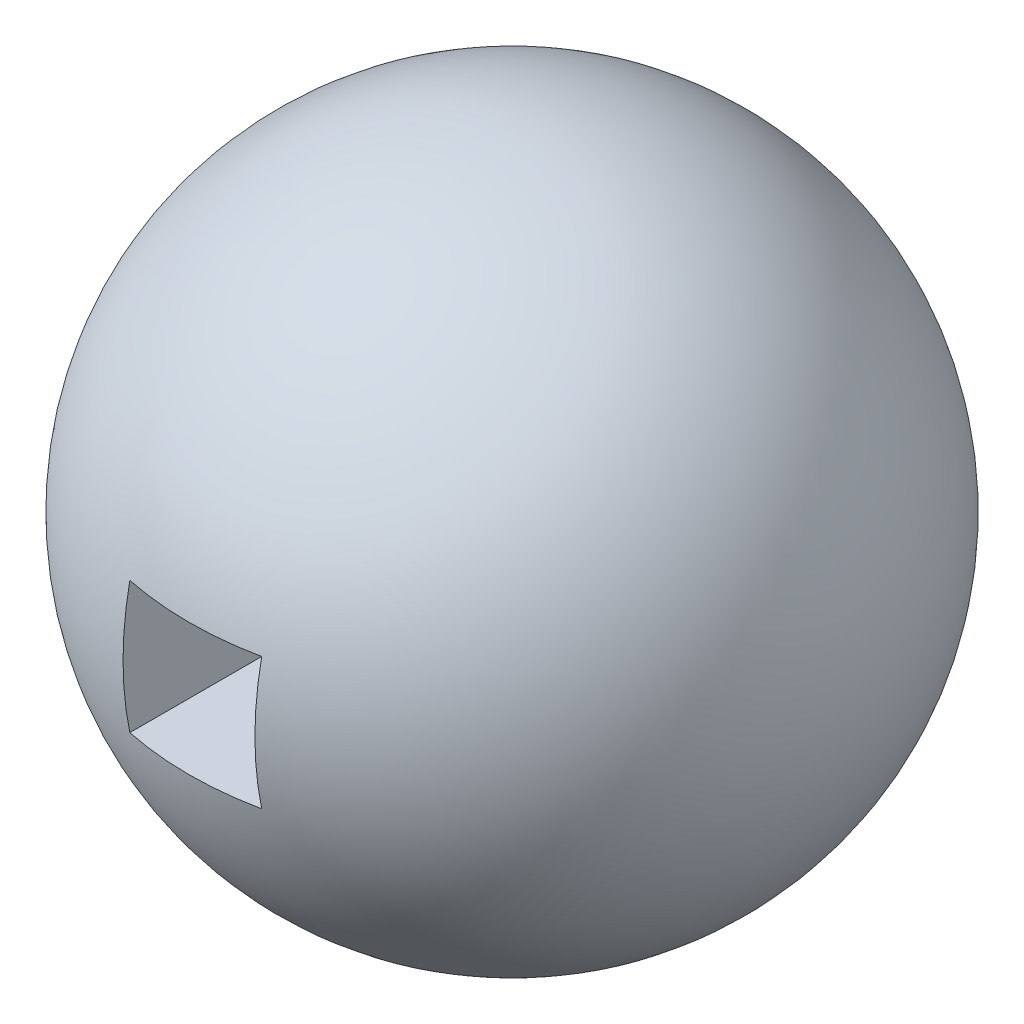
from build123d import *

# Parameters (mm, degrees)
CUT_EXTRUDE1_REACH                  = 6.33
CUT_EXTRUDE1_END_RADIUS             = 2.5
SKETCH2_W                           = 1
SKETCH2_H                           = 1
CUT_EXTRUDE1_DIRECTION_2_REACH      = 6.33
CUT_EXTRUDE1_DIRECTION_2_END_RADIUS = 2.5


with BuildPart() as part:
    # Sketch1 → Revolve1 (revolve)
    with BuildSketch(Plane.XY):
        with BuildLine():
            Line((0, 2.5), (0, -2.5))
            ThreePointArc((0, -2.5), (-2.5, 0), (0, 2.5))
        make_face()
    revolve(axis=Axis((0, 2.5, 0), (0, -1, 0)))

    # Cut-Extrude1: up to this sphere (the profile starts inside it)
    cut_extrude1_end = Location((0, 0, 0)) * Sphere(CUT_EXTRUDE1_END_RADIUS, mode=Mode.PRIVATE)
    # Sketch2 → Cut-Extrude1 (cut, up to the surface)
    with BuildSketch(Plane.XY, mode=Mode.PRIVATE) as cut_extrude1_sk1:
        Rectangle(SKETCH2_W, SKETCH2_H)
    cut_extrude1_tool1 = extrude(cut_extrude1_sk1.sketch, amount=-CUT_EXTRUDE1_REACH, mode=Mode.PRIVATE) & cut_extrude1_end
    add(cut_extrude1_tool1.solids().sort_by_distance((0, 0, 0))[0], mode=Mode.SUBTRACT)

    # Cut-Extrude1 direction 2: up to this sphere (the profile starts inside it)
    cut_extrude1_direction_2_end = Location((0, 0, 0)) * Sphere(CUT_EXTRUDE1_DIRECTION_2_END_RADIUS, mode=Mode.PRIVATE)
    # Sketch2 → Cut-Extrude1 direction 2 (cut, up to the surface)
    with BuildSketch(Plane.XY, mode=Mode.PRIVATE) as cut_extrude1_direction_2_sk1:
        Rectangle(SKETCH2_W, SKETCH2_H)
    cut_extrude1_direction_2_tool1 = extrude(cut_extrude1_direction_2_sk1.sketch, amount=CUT_EXTRUDE1_DIRECTION_2_REACH, mode=Mode.PRIVATE) & cut_extrude1_direction_2_end
    add(cut_extrude1_direction_2_tool1.solids().sort_by_distance((0, 0, 0))[0], mode=Mode.SUBTRACT)


solid = part.part
